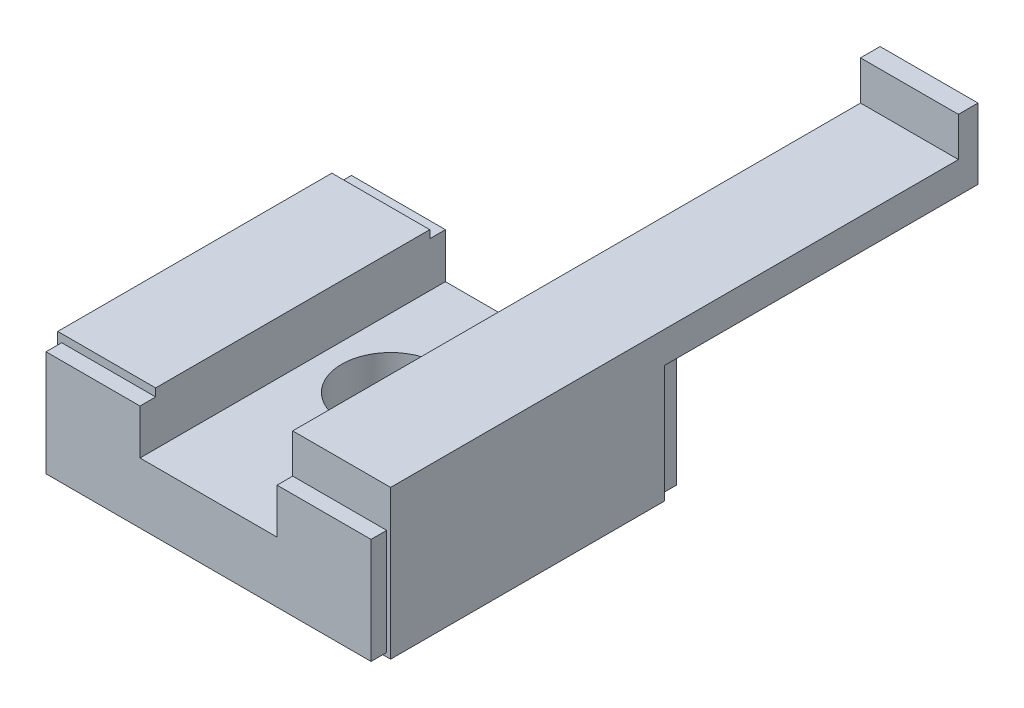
ISO-10303-21;
HEADER;
FILE_DESCRIPTION(('STEP AP214'),'2;1');
FILE_NAME('part.step','',(''),(''),'','','');
FILE_SCHEMA(('AUTOMOTIVE_DESIGN { 1 0 10303 214 1 1 1 1 }'));
ENDSEC;
DATA;
#1=APPLICATION_CONTEXT('core data for automotive mechanical design processes');
#2=APPLICATION_PROTOCOL_DEFINITION('international standard','automotive_design',2000,#1);
#3=PRODUCT_CONTEXT('',#1,'mechanical');
#4=PRODUCT('Part','Part','',(#3));
#5=PRODUCT_RELATED_PRODUCT_CATEGORY('part','',(#4));
#6=PRODUCT_DEFINITION_FORMATION('','',#4);
#7=PRODUCT_DEFINITION_CONTEXT('part definition',#1,'design');
#8=PRODUCT_DEFINITION('design','',#6,#7);
#9=PRODUCT_DEFINITION_SHAPE('','',#8);
#10=(LENGTH_UNIT() NAMED_UNIT(*) SI_UNIT(.MILLI.,.METRE.));
#11=(NAMED_UNIT(*) PLANE_ANGLE_UNIT() SI_UNIT($,.RADIAN.));
#12=(NAMED_UNIT(*) SI_UNIT($,.STERADIAN.) SOLID_ANGLE_UNIT());
#13=UNCERTAINTY_MEASURE_WITH_UNIT(LENGTH_MEASURE(1.E-05),#10,'distance_accuracy_value','');
#14=(GEOMETRIC_REPRESENTATION_CONTEXT(3) GLOBAL_UNCERTAINTY_ASSIGNED_CONTEXT((#13)) GLOBAL_UNIT_ASSIGNED_CONTEXT((#10,
#11,#12)) REPRESENTATION_CONTEXT('',''));
#15=CARTESIAN_POINT('',(0.,0.,0.));
#16=DIRECTION('',(0.,0.,1.));
#17=DIRECTION('',(1.,0.,0.));
#18=AXIS2_PLACEMENT_3D('',#15,#16,#17);
#19=CARTESIAN_POINT('',(3.5,7.6,14.8));
#20=DIRECTION('',(0.,1.,0.));
#21=DIRECTION('',(1.,0.,0.));
#22=AXIS2_PLACEMENT_3D('',#19,#20,#21);
#23=PLANE('',#22);
#24=DIRECTION('',(-1.,0.,0.));
#25=VECTOR('',#24,1.);
#26=CARTESIAN_POINT('',(8.5,7.6,-14.2));
#27=LINE('',#26,#25);
#28=CARTESIAN_POINT('',(3.5,7.6,-14.2));
#29=VERTEX_POINT('',#28);
#30=CARTESIAN_POINT('',(8.5,7.6,-14.2));
#31=VERTEX_POINT('',#30);
#32=EDGE_CURVE('E197',#29,#31,#27,.F.);
#33=ORIENTED_EDGE('',*,*,#32,.F.);
#34=DIRECTION('',(0.,0.,1.));
#35=VECTOR('',#34,1.);
#36=CARTESIAN_POINT('',(3.5,7.6,-14.2));
#37=LINE('',#36,#35);
#38=CARTESIAN_POINT('',(3.5,7.6,14.8));
#39=VERTEX_POINT('',#38);
#40=EDGE_CURVE('E212',#39,#29,#37,.F.);
#41=ORIENTED_EDGE('',*,*,#40,.F.);
#42=DIRECTION('',(1.,0.,0.));
#43=VECTOR('',#42,1.);
#44=CARTESIAN_POINT('',(3.5,7.6,14.8));
#45=LINE('',#44,#43);
#46=CARTESIAN_POINT('',(8.5,7.6,14.8));
#47=VERTEX_POINT('',#46);
#48=EDGE_CURVE('E221',#47,#39,#45,.F.);
#49=ORIENTED_EDGE('',*,*,#48,.F.);
#50=DIRECTION('',(0.,0.,-1.));
#51=VECTOR('',#50,1.);
#52=CARTESIAN_POINT('',(8.5,7.6,14.8));
#53=LINE('',#52,#51);
#54=EDGE_CURVE('E214',#47,#31,#53,.T.);
#55=ORIENTED_EDGE('',*,*,#54,.T.);
#56=EDGE_LOOP('',(#33,#41,#49,#55));
#57=FACE_BOUND('',#56,.T.);
#58=ADVANCED_FACE('F16',(#57),#23,.T.);
#59=CARTESIAN_POINT('',(-8.5,6.,14.8));
#60=DIRECTION('',(0.,1.,0.));
#61=DIRECTION('',(1.,0.,0.));
#62=AXIS2_PLACEMENT_3D('',#59,#60,#61);
#63=PLANE('',#62);
#64=DIRECTION('',(1.,0.,0.));
#65=VECTOR('',#64,1.);
#66=CARTESIAN_POINT('',(-8.5,6.,14.8));
#67=LINE('',#66,#65);
#68=CARTESIAN_POINT('',(-3.5,6.,14.8));
#69=VERTEX_POINT('',#68);
#70=CARTESIAN_POINT('',(-8.5,6.,14.8));
#71=VERTEX_POINT('',#70);
#72=EDGE_CURVE('E232',#69,#71,#67,.F.);
#73=ORIENTED_EDGE('',*,*,#72,.F.);
#74=DIRECTION('',(0.,0.,-1.));
#75=VECTOR('',#74,1.);
#76=CARTESIAN_POINT('',(-3.5,6.,14.8));
#77=LINE('',#76,#75);
#78=CARTESIAN_POINT('',(-3.5,6.,0.800000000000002));
#79=VERTEX_POINT('',#78);
#80=EDGE_CURVE('E236',#69,#79,#77,.T.);
#81=ORIENTED_EDGE('',*,*,#80,.T.);
#82=DIRECTION('',(-1.,0.,0.));
#83=VECTOR('',#82,1.);
#84=CARTESIAN_POINT('',(-3.5,6.,0.800000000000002));
#85=LINE('',#84,#83);
#86=CARTESIAN_POINT('',(-8.5,6.,0.800000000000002));
#87=VERTEX_POINT('',#86);
#88=EDGE_CURVE('E241',#79,#87,#85,.T.);
#89=ORIENTED_EDGE('',*,*,#88,.T.);
#90=DIRECTION('',(0.,0.,1.));
#91=VECTOR('',#90,1.);
#92=CARTESIAN_POINT('',(-8.5,6.,0.800000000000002));
#93=LINE('',#92,#91);
#94=EDGE_CURVE('E246',#71,#87,#93,.F.);
#95=ORIENTED_EDGE('',*,*,#94,.F.);
#96=EDGE_LOOP('',(#73,#81,#89,#95));
#97=FACE_BOUND('',#96,.T.);
#98=ADVANCED_FACE('F620',(#97),#63,.T.);
#99=CARTESIAN_POINT('',(-8.5,0.,14.8));
#100=DIRECTION('',(-1.,0.,0.));
#101=DIRECTION('',(0.,1.,0.));
#102=AXIS2_PLACEMENT_3D('',#99,#100,#101);
#103=PLANE('',#102);
#104=DIRECTION('',(0.,1.,0.));
#105=VECTOR('',#104,1.);
#106=CARTESIAN_POINT('',(-8.5,0.,14.8));
#107=LINE('',#106,#105);
#108=CARTESIAN_POINT('',(-8.5,0.,14.8));
#109=VERTEX_POINT('',#108);
#110=EDGE_CURVE('E251',#71,#109,#107,.F.);
#111=ORIENTED_EDGE('',*,*,#110,.F.);
#112=ORIENTED_EDGE('',*,*,#94,.T.);
#113=DIRECTION('',(0.,-1.,0.));
#114=VECTOR('',#113,1.);
#115=CARTESIAN_POINT('',(-8.5,6.,0.800000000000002));
#116=LINE('',#115,#114);
#117=CARTESIAN_POINT('',(-8.5,0.,0.800000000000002));
#118=VERTEX_POINT('',#117);
#119=EDGE_CURVE('E255',#87,#118,#116,.T.);
#120=ORIENTED_EDGE('',*,*,#119,.T.);
#121=DIRECTION('',(0.,0.,1.));
#122=VECTOR('',#121,1.);
#123=CARTESIAN_POINT('',(-8.5,0.,0.800000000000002));
#124=LINE('',#123,#122);
#125=EDGE_CURVE('E260',#109,#118,#124,.F.);
#126=ORIENTED_EDGE('',*,*,#125,.F.);
#127=EDGE_LOOP('',(#111,#112,#120,#126));
#128=FACE_BOUND('',#127,.T.);
#129=ADVANCED_FACE('F625',(#128),#103,.T.);
#130=CARTESIAN_POINT('',(-8.5,0.,0.800000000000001));
#131=DIRECTION('',(0.,-1.,0.));
#132=DIRECTION('',(1.,0.,0.));
#133=AXIS2_PLACEMENT_3D('',#130,#131,#132);
#134=PLANE('',#133);
#135=DIRECTION('',(-1.,0.,0.));
#136=VECTOR('',#135,1.);
#137=CARTESIAN_POINT('',(-3.5,0.,14.8));
#138=LINE('',#137,#136);
#139=CARTESIAN_POINT('',(-3.5,0.,14.8));
#140=VERTEX_POINT('',#139);
#141=EDGE_CURVE('E265',#109,#140,#138,.F.);
#142=ORIENTED_EDGE('',*,*,#141,.F.);
#143=ORIENTED_EDGE('',*,*,#125,.T.);
#144=DIRECTION('',(1.,0.,0.));
#145=VECTOR('',#144,1.);
#146=CARTESIAN_POINT('',(-8.5,0.,0.800000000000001));
#147=LINE('',#146,#145);
#148=CARTESIAN_POINT('',(-3.5,0.,0.800000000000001));
#149=VERTEX_POINT('',#148);
#150=EDGE_CURVE('E269',#118,#149,#147,.T.);
#151=ORIENTED_EDGE('',*,*,#150,.T.);
#152=DIRECTION('',(0.,0.,1.));
#153=VECTOR('',#152,1.);
#154=CARTESIAN_POINT('',(-3.5,0.,0.800000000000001));
#155=LINE('',#154,#153);
#156=EDGE_CURVE('E274',#140,#149,#155,.F.);
#157=ORIENTED_EDGE('',*,*,#156,.F.);
#158=EDGE_LOOP('',(#142,#143,#151,#157));
#159=FACE_BOUND('',#158,.T.);
#160=CARTESIAN_POINT('',(-6.,0.,7.8));
#161=DIRECTION('',(0.,1.,0.));
#162=DIRECTION('',(0.,0.,-1.));
#163=AXIS2_PLACEMENT_3D('',#160,#161,#162);
#164=CIRCLE('',#163,1.25);
#165=CARTESIAN_POINT('',(-6.,0.,6.55));
#166=VERTEX_POINT('',#165);
#167=EDGE_CURVE('E279',#166,#166,#164,.F.);
#168=ORIENTED_EDGE('',*,*,#167,.F.);
#169=EDGE_LOOP('',(#168));
#170=FACE_BOUND('',#169,.T.);
#171=ADVANCED_FACE('F631',(#159,#170),#134,.T.);
#172=CARTESIAN_POINT('',(-3.3,0.2,0.800000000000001));
#173=DIRECTION('',(0.707106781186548,-0.707106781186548,0.));
#174=DIRECTION('',(0.,0.,1.));
#175=AXIS2_PLACEMENT_3D('',#172,#173,#174);
#176=PLANE('',#175);
#177=DIRECTION('',(-0.707106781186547,-0.707106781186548,0.));
#178=VECTOR('',#177,1.);
#179=CARTESIAN_POINT('',(-3.3,0.2,14.8));
#180=LINE('',#179,#178);
#181=CARTESIAN_POINT('',(-3.3,0.2,14.8));
#182=VERTEX_POINT('',#181);
#183=EDGE_CURVE('E284',#140,#182,#180,.F.);
#184=ORIENTED_EDGE('',*,*,#183,.F.);
#185=ORIENTED_EDGE('',*,*,#156,.T.);
#186=DIRECTION('',(0.707106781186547,0.707106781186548,0.));
#187=VECTOR('',#186,1.);
#188=CARTESIAN_POINT('',(-3.5,0.,0.800000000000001));
#189=LINE('',#188,#187);
#190=CARTESIAN_POINT('',(-3.3,0.2,0.800000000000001));
#191=VERTEX_POINT('',#190);
#192=EDGE_CURVE('E286',#149,#191,#189,.T.);
#193=ORIENTED_EDGE('',*,*,#192,.T.);
#194=DIRECTION('',(0.,0.,1.));
#195=VECTOR('',#194,1.);
#196=CARTESIAN_POINT('',(-3.3,0.2,0.800000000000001));
#197=LINE('',#196,#195);
#198=EDGE_CURVE('E291',#182,#191,#197,.F.);
#199=ORIENTED_EDGE('',*,*,#198,.F.);
#200=EDGE_LOOP('',(#184,#185,#193,#199));
#201=FACE_BOUND('',#200,.T.);
#202=ADVANCED_FACE('F635',(#201),#176,.T.);
#203=CARTESIAN_POINT('',(3.5,0.,0.800000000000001));
#204=DIRECTION('',(-0.707106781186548,-0.707106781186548,0.));
#205=DIRECTION('',(0.,0.,1.));
#206=AXIS2_PLACEMENT_3D('',#203,#204,#205);
#207=PLANE('',#206);
#208=DIRECTION('',(-0.707106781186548,0.707106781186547,0.));
#209=VECTOR('',#208,1.);
#210=CARTESIAN_POINT('',(3.5,0.,14.8));
#211=LINE('',#210,#209);
#212=CARTESIAN_POINT('',(3.3,0.2,14.8));
#213=VERTEX_POINT('',#212);
#214=CARTESIAN_POINT('',(3.5,0.,14.8));
#215=VERTEX_POINT('',#214);
#216=EDGE_CURVE('E296',#213,#215,#211,.F.);
#217=ORIENTED_EDGE('',*,*,#216,.F.);
#218=DIRECTION('',(0.,0.,-1.));
#219=VECTOR('',#218,1.);
#220=CARTESIAN_POINT('',(3.3,0.2,14.8));
#221=LINE('',#220,#219);
#222=CARTESIAN_POINT('',(3.3,0.2,0.800000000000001));
#223=VERTEX_POINT('',#222);
#224=EDGE_CURVE('E300',#213,#223,#221,.T.);
#225=ORIENTED_EDGE('',*,*,#224,.T.);
#226=DIRECTION('',(0.707106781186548,-0.707106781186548,0.));
#227=VECTOR('',#226,1.);
#228=CARTESIAN_POINT('',(3.3,0.2,0.800000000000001));
#229=LINE('',#228,#227);
#230=CARTESIAN_POINT('',(3.5,0.,0.800000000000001));
#231=VERTEX_POINT('',#230);
#232=EDGE_CURVE('E305',#223,#231,#229,.T.);
#233=ORIENTED_EDGE('',*,*,#232,.T.);
#234=DIRECTION('',(0.,0.,1.));
#235=VECTOR('',#234,1.);
#236=CARTESIAN_POINT('',(3.5,0.,0.800000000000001));
#237=LINE('',#236,#235);
#238=EDGE_CURVE('E310',#215,#231,#237,.F.);
#239=ORIENTED_EDGE('',*,*,#238,.F.);
#240=EDGE_LOOP('',(#217,#225,#233,#239));
#241=FACE_BOUND('',#240,.T.);
#242=ADVANCED_FACE('F639',(#241),#207,.T.);
#243=CARTESIAN_POINT('',(3.5,0.,0.800000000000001));
#244=DIRECTION('',(0.,-1.,0.));
#245=DIRECTION('',(1.,0.,0.));
#246=AXIS2_PLACEMENT_3D('',#243,#244,#245);
#247=PLANE('',#246);
#248=DIRECTION('',(-1.,0.,0.));
#249=VECTOR('',#248,1.);
#250=CARTESIAN_POINT('',(8.5,0.,14.8));
#251=LINE('',#250,#249);
#252=CARTESIAN_POINT('',(8.5,0.,14.8));
#253=VERTEX_POINT('',#252);
#254=EDGE_CURVE('E315',#215,#253,#251,.F.);
#255=ORIENTED_EDGE('',*,*,#254,.F.);
#256=ORIENTED_EDGE('',*,*,#238,.T.);
#257=DIRECTION('',(1.,0.,0.));
#258=VECTOR('',#257,1.);
#259=CARTESIAN_POINT('',(3.5,0.,0.800000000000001));
#260=LINE('',#259,#258);
#261=CARTESIAN_POINT('',(8.5,0.,0.800000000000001));
#262=VERTEX_POINT('',#261);
#263=EDGE_CURVE('E319',#231,#262,#260,.T.);
#264=ORIENTED_EDGE('',*,*,#263,.T.);
#265=DIRECTION('',(0.,0.,1.));
#266=VECTOR('',#265,1.);
#267=CARTESIAN_POINT('',(8.5,0.,0.800000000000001));
#268=LINE('',#267,#266);
#269=EDGE_CURVE('E324',#253,#262,#268,.F.);
#270=ORIENTED_EDGE('',*,*,#269,.F.);
#271=EDGE_LOOP('',(#255,#256,#264,#270));
#272=FACE_BOUND('',#271,.T.);
#273=CARTESIAN_POINT('',(6.,0.,7.8));
#274=DIRECTION('',(0.,1.,0.));
#275=DIRECTION('',(0.,0.,-1.));
#276=AXIS2_PLACEMENT_3D('',#273,#274,#275);
#277=CIRCLE('',#276,1.25);
#278=CARTESIAN_POINT('',(6.,0.,6.55));
#279=VERTEX_POINT('',#278);
#280=EDGE_CURVE('E329',#279,#279,#277,.F.);
#281=ORIENTED_EDGE('',*,*,#280,.F.);
#282=EDGE_LOOP('',(#281));
#283=FACE_BOUND('',#282,.T.);
#284=ADVANCED_FACE('F643',(#272,#283),#247,.T.);
#285=CARTESIAN_POINT('',(8.5,0.,-15.2));
#286=DIRECTION('',(1.,0.,0.));
#287=DIRECTION('',(0.,1.,0.));
#288=AXIS2_PLACEMENT_3D('',#285,#286,#287);
#289=PLANE('',#288);
#290=DIRECTION('',(0.,-1.,0.));
#291=VECTOR('',#290,1.);
#292=CARTESIAN_POINT('',(8.5,7.6,14.8));
#293=LINE('',#292,#291);
#294=EDGE_CURVE('E334',#253,#47,#293,.F.);
#295=ORIENTED_EDGE('',*,*,#294,.F.);
#296=ORIENTED_EDGE('',*,*,#269,.T.);
#297=DIRECTION('',(0.,1.,0.));
#298=VECTOR('',#297,1.);
#299=CARTESIAN_POINT('',(8.5,0.,0.800000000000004));
#300=LINE('',#299,#298);
#301=CARTESIAN_POINT('',(8.5,6.,0.800000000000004));
#302=VERTEX_POINT('',#301);
#303=EDGE_CURVE('E336',#262,#302,#300,.T.);
#304=ORIENTED_EDGE('',*,*,#303,.T.);
#305=DIRECTION('',(0.,0.,-1.));
#306=VECTOR('',#305,1.);
#307=CARTESIAN_POINT('',(8.5,6.,0.800000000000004));
#308=LINE('',#307,#306);
#309=CARTESIAN_POINT('',(8.5,6.,-15.2));
#310=VERTEX_POINT('',#309);
#311=EDGE_CURVE('E341',#310,#302,#308,.F.);
#312=ORIENTED_EDGE('',*,*,#311,.F.);
#313=DIRECTION('',(0.,1.,0.));
#314=VECTOR('',#313,1.);
#315=CARTESIAN_POINT('',(8.5,6.,-15.2));
#316=LINE('',#315,#314);
#317=CARTESIAN_POINT('',(8.5,9.6,-15.2));
#318=VERTEX_POINT('',#317);
#319=EDGE_CURVE('E345',#310,#318,#316,.T.);
#320=ORIENTED_EDGE('',*,*,#319,.T.);
#321=DIRECTION('',(0.,0.,1.));
#322=VECTOR('',#321,1.);
#323=CARTESIAN_POINT('',(8.5,9.6,-15.2));
#324=LINE('',#323,#322);
#325=CARTESIAN_POINT('',(8.5,9.6,-14.2));
#326=VERTEX_POINT('',#325);
#327=EDGE_CURVE('E350',#326,#318,#324,.F.);
#328=ORIENTED_EDGE('',*,*,#327,.F.);
#329=DIRECTION('',(0.,-1.,0.));
#330=VECTOR('',#329,1.);
#331=CARTESIAN_POINT('',(8.5,9.6,-14.2));
#332=LINE('',#331,#330);
#333=EDGE_CURVE('E354',#31,#326,#332,.F.);
#334=ORIENTED_EDGE('',*,*,#333,.F.);
#335=ORIENTED_EDGE('',*,*,#54,.F.);
#336=EDGE_LOOP('',(#295,#296,#304,#312,#320,#328,#334,#335));
#337=FACE_BOUND('',#336,.T.);
#338=ADVANCED_FACE('F647',(#337),#289,.T.);
#339=CARTESIAN_POINT('',(3.5,3.3,15.6));
#340=DIRECTION('',(-1.,0.,0.));
#341=DIRECTION('',(0.,1.,0.));
#342=AXIS2_PLACEMENT_3D('',#339,#340,#341);
#343=PLANE('',#342);
#344=DIRECTION('',(0.,1.,0.));
#345=VECTOR('',#344,1.);
#346=CARTESIAN_POINT('',(3.5,3.3,15.6));
#347=LINE('',#346,#345);
#348=CARTESIAN_POINT('',(3.5,5.6,15.6));
#349=VERTEX_POINT('',#348);
#350=CARTESIAN_POINT('',(3.5,3.3,15.6));
#351=VERTEX_POINT('',#350);
#352=EDGE_CURVE('E358',#349,#351,#347,.F.);
#353=ORIENTED_EDGE('',*,*,#352,.F.);
#354=DIRECTION('',(0.,0.,-1.));
#355=VECTOR('',#354,1.);
#356=CARTESIAN_POINT('',(3.5,5.6,15.6));
#357=LINE('',#356,#355);
#358=CARTESIAN_POINT('',(3.5,5.6,14.8));
#359=VERTEX_POINT('',#358);
#360=EDGE_CURVE('E362',#359,#349,#357,.F.);
#361=ORIENTED_EDGE('',*,*,#360,.F.);
#362=DIRECTION('',(0.,1.,0.));
#363=VECTOR('',#362,1.);
#364=CARTESIAN_POINT('',(3.5,5.6,14.8));
#365=LINE('',#364,#363);
#366=EDGE_CURVE('E206',#39,#359,#365,.F.);
#367=ORIENTED_EDGE('',*,*,#366,.F.);
#368=ORIENTED_EDGE('',*,*,#40,.T.);
#369=DIRECTION('',(0.,1.,0.));
#370=VECTOR('',#369,1.);
#371=CARTESIAN_POINT('',(3.5,7.6,-14.2));
#372=LINE('',#371,#370);
#373=CARTESIAN_POINT('',(3.5,9.6,-14.2));
#374=VERTEX_POINT('',#373);
#375=EDGE_CURVE('E194',#374,#29,#372,.F.);
#376=ORIENTED_EDGE('',*,*,#375,.F.);
#377=DIRECTION('',(0.,0.,-1.));
#378=VECTOR('',#377,1.);
#379=CARTESIAN_POINT('',(3.5,9.6,-14.2));
#380=LINE('',#379,#378);
#381=CARTESIAN_POINT('',(3.5,9.6,-15.2));
#382=VERTEX_POINT('',#381);
#383=EDGE_CURVE('E205',#374,#382,#380,.T.);
#384=ORIENTED_EDGE('',*,*,#383,.T.);
#385=DIRECTION('',(0.,-1.,0.));
#386=VECTOR('',#385,1.);
#387=CARTESIAN_POINT('',(3.5,9.6,-15.2));
#388=LINE('',#387,#386);
#389=CARTESIAN_POINT('',(3.5,6.,-15.2));
#390=VERTEX_POINT('',#389);
#391=EDGE_CURVE('E374',#382,#390,#388,.T.);
#392=ORIENTED_EDGE('',*,*,#391,.T.);
#393=DIRECTION('',(0.,0.,1.));
#394=VECTOR('',#393,1.);
#395=CARTESIAN_POINT('',(3.5,6.,-15.2));
#396=LINE('',#395,#394);
#397=CARTESIAN_POINT('',(3.5,6.,0.));
#398=VERTEX_POINT('',#397);
#399=EDGE_CURVE('E379',#390,#398,#396,.T.);
#400=ORIENTED_EDGE('',*,*,#399,.T.);
#401=DIRECTION('',(0.,-1.,0.));
#402=VECTOR('',#401,1.);
#403=CARTESIAN_POINT('',(3.5,6.,0.));
#404=LINE('',#403,#402);
#405=CARTESIAN_POINT('',(3.5,3.3,0.));
#406=VERTEX_POINT('',#405);
#407=EDGE_CURVE('E384',#398,#406,#404,.T.);
#408=ORIENTED_EDGE('',*,*,#407,.T.);
#409=DIRECTION('',(0.,0.,1.));
#410=VECTOR('',#409,1.);
#411=CARTESIAN_POINT('',(3.5,3.3,0.));
#412=LINE('',#411,#410);
#413=EDGE_CURVE('E389',#351,#406,#412,.F.);
#414=ORIENTED_EDGE('',*,*,#413,.F.);
#415=EDGE_LOOP('',(#353,#361,#367,#368,#376,#384,#392,#400,#408,#414));
#416=FACE_BOUND('',#415,.T.);
#417=ADVANCED_FACE('F218',(#416),#343,.T.);
#418=CARTESIAN_POINT('',(-3.5,3.3,0.));
#419=DIRECTION('',(1.,0.,0.));
#420=DIRECTION('',(0.,1.,0.));
#421=AXIS2_PLACEMENT_3D('',#418,#419,#420);
#422=PLANE('',#421);
#423=DIRECTION('',(0.,-1.,0.));
#424=VECTOR('',#423,1.);
#425=CARTESIAN_POINT('',(-3.5,6.,14.8));
#426=LINE('',#425,#424);
#427=CARTESIAN_POINT('',(-3.5,5.6,14.8));
#428=VERTEX_POINT('',#427);
#429=EDGE_CURVE('E393',#428,#69,#426,.F.);
#430=ORIENTED_EDGE('',*,*,#429,.F.);
#431=DIRECTION('',(0.,0.,1.));
#432=VECTOR('',#431,1.);
#433=CARTESIAN_POINT('',(-3.5,5.6,14.8));
#434=LINE('',#433,#432);
#435=CARTESIAN_POINT('',(-3.5,5.6,15.6));
#436=VERTEX_POINT('',#435);
#437=EDGE_CURVE('E397',#428,#436,#434,.T.);
#438=ORIENTED_EDGE('',*,*,#437,.T.);
#439=DIRECTION('',(0.,-1.,0.));
#440=VECTOR('',#439,1.);
#441=CARTESIAN_POINT('',(-3.5,5.6,15.6));
#442=LINE('',#441,#440);
#443=CARTESIAN_POINT('',(-3.5,3.3,15.6));
#444=VERTEX_POINT('',#443);
#445=EDGE_CURVE('E402',#444,#436,#442,.F.);
#446=ORIENTED_EDGE('',*,*,#445,.F.);
#447=DIRECTION('',(0.,0.,-1.));
#448=VECTOR('',#447,1.);
#449=CARTESIAN_POINT('',(-3.5,3.3,15.6));
#450=LINE('',#449,#448);
#451=CARTESIAN_POINT('',(-3.5,3.3,0.));
#452=VERTEX_POINT('',#451);
#453=EDGE_CURVE('E407',#444,#452,#450,.T.);
#454=ORIENTED_EDGE('',*,*,#453,.T.);
#455=DIRECTION('',(0.,1.,0.));
#456=VECTOR('',#455,1.);
#457=CARTESIAN_POINT('',(-3.5,3.3,0.));
#458=LINE('',#457,#456);
#459=CARTESIAN_POINT('',(-3.5,5.6,0.));
#460=VERTEX_POINT('',#459);
#461=EDGE_CURVE('E412',#452,#460,#458,.T.);
#462=ORIENTED_EDGE('',*,*,#461,.T.);
#463=DIRECTION('',(0.,0.,1.));
#464=VECTOR('',#463,1.);
#465=CARTESIAN_POINT('',(-3.5,5.6,0.));
#466=LINE('',#465,#464);
#467=CARTESIAN_POINT('',(-3.5,5.6,0.800000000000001));
#468=VERTEX_POINT('',#467);
#469=EDGE_CURVE('E417',#468,#460,#466,.F.);
#470=ORIENTED_EDGE('',*,*,#469,.F.);
#471=DIRECTION('',(0.,1.,0.));
#472=VECTOR('',#471,1.);
#473=CARTESIAN_POINT('',(-3.5,5.6,0.800000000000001));
#474=LINE('',#473,#472);
#475=EDGE_CURVE('E421',#468,#79,#474,.T.);
#476=ORIENTED_EDGE('',*,*,#475,.T.);
#477=ORIENTED_EDGE('',*,*,#80,.F.);
#478=EDGE_LOOP('',(#430,#438,#446,#454,#462,#470,#476,#477));
#479=FACE_BOUND('',#478,.T.);
#480=ADVANCED_FACE('F654',(#479),#422,.T.);
#481=CARTESIAN_POINT('',(-8.3,0.2,0.));
#482=DIRECTION('',(0.,0.,-1.));
#483=DIRECTION('',(0.,1.,0.));
#484=AXIS2_PLACEMENT_3D('',#481,#482,#483);
#485=PLANE('',#484);
#486=DIRECTION('',(1.,0.,0.));
#487=VECTOR('',#486,1.);
#488=CARTESIAN_POINT('',(3.5,6.,0.));
#489=LINE('',#488,#487);
#490=CARTESIAN_POINT('',(8.3,6.,0.));
#491=VERTEX_POINT('',#490);
#492=EDGE_CURVE('E426',#398,#491,#489,.T.);
#493=ORIENTED_EDGE('',*,*,#492,.T.);
#494=DIRECTION('',(0.,-1.,0.));
#495=VECTOR('',#494,1.);
#496=CARTESIAN_POINT('',(8.3,6.,0.));
#497=LINE('',#496,#495);
#498=CARTESIAN_POINT('',(8.3,0.200000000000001,0.));
#499=VERTEX_POINT('',#498);
#500=EDGE_CURVE('E431',#491,#499,#497,.T.);
#501=ORIENTED_EDGE('',*,*,#500,.T.);
#502=DIRECTION('',(-1.,0.,0.));
#503=VECTOR('',#502,1.);
#504=CARTESIAN_POINT('',(8.3,0.2,0.));
#505=LINE('',#504,#503);
#506=CARTESIAN_POINT('',(-8.3,0.2,0.));
#507=VERTEX_POINT('',#506);
#508=EDGE_CURVE('E436',#507,#499,#505,.F.);
#509=ORIENTED_EDGE('',*,*,#508,.F.);
#510=DIRECTION('',(0.,1.,0.));
#511=VECTOR('',#510,1.);
#512=CARTESIAN_POINT('',(-8.3,0.2,0.));
#513=LINE('',#512,#511);
#514=CARTESIAN_POINT('',(-8.3,5.6,0.));
#515=VERTEX_POINT('',#514);
#516=EDGE_CURVE('E441',#507,#515,#513,.T.);
#517=ORIENTED_EDGE('',*,*,#516,.T.);
#518=DIRECTION('',(1.,0.,0.));
#519=VECTOR('',#518,1.);
#520=CARTESIAN_POINT('',(-8.3,5.6,0.));
#521=LINE('',#520,#519);
#522=EDGE_CURVE('E446',#515,#460,#521,.T.);
#523=ORIENTED_EDGE('',*,*,#522,.T.);
#524=ORIENTED_EDGE('',*,*,#461,.F.);
#525=DIRECTION('',(1.,0.,0.));
#526=VECTOR('',#525,1.);
#527=CARTESIAN_POINT('',(-3.5,3.3,0.));
#528=LINE('',#527,#526);
#529=EDGE_CURVE('E451',#406,#452,#528,.F.);
#530=ORIENTED_EDGE('',*,*,#529,.F.);
#531=ORIENTED_EDGE('',*,*,#407,.F.);
#532=EDGE_LOOP('',(#493,#501,#509,#517,#523,#524,#530,#531));
#533=FACE_BOUND('',#532,.T.);
#534=ADVANCED_FACE('F657',(#533),#485,.T.);
#535=CARTESIAN_POINT('',(-8.3,0.2,0.));
#536=DIRECTION('',(0.,-1.,0.));
#537=DIRECTION('',(1.,0.,0.));
#538=AXIS2_PLACEMENT_3D('',#535,#536,#537);
#539=PLANE('',#538);
#540=DIRECTION('',(-1.,0.,0.));
#541=VECTOR('',#540,1.);
#542=CARTESIAN_POINT('',(8.3,0.2,15.6));
#543=LINE('',#542,#541);
#544=CARTESIAN_POINT('',(-8.3,0.2,15.6));
#545=VERTEX_POINT('',#544);
#546=CARTESIAN_POINT('',(8.3,0.2,15.6));
#547=VERTEX_POINT('',#546);
#548=EDGE_CURVE('E455',#545,#547,#543,.F.);
#549=ORIENTED_EDGE('',*,*,#548,.F.);
#550=DIRECTION('',(0.,0.,-1.));
#551=VECTOR('',#550,1.);
#552=CARTESIAN_POINT('',(-8.3,0.2,15.6));
#553=LINE('',#552,#551);
#554=CARTESIAN_POINT('',(-8.3,0.2,14.8));
#555=VERTEX_POINT('',#554);
#556=EDGE_CURVE('E460',#555,#545,#553,.F.);
#557=ORIENTED_EDGE('',*,*,#556,.F.);
#558=DIRECTION('',(1.,0.,0.));
#559=VECTOR('',#558,1.);
#560=CARTESIAN_POINT('',(-8.3,0.2,14.8));
#561=LINE('',#560,#559);
#562=EDGE_CURVE('E464',#182,#555,#561,.F.);
#563=ORIENTED_EDGE('',*,*,#562,.F.);
#564=ORIENTED_EDGE('',*,*,#198,.T.);
#565=DIRECTION('',(-1.,0.,0.));
#566=VECTOR('',#565,1.);
#567=CARTESIAN_POINT('',(-3.3,0.2,0.800000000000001));
#568=LINE('',#567,#566);
#569=CARTESIAN_POINT('',(-8.3,0.2,0.800000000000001));
#570=VERTEX_POINT('',#569);
#571=EDGE_CURVE('E468',#191,#570,#568,.T.);
#572=ORIENTED_EDGE('',*,*,#571,.T.);
#573=DIRECTION('',(0.,0.,-1.));
#574=VECTOR('',#573,1.);
#575=CARTESIAN_POINT('',(-8.3,0.2,0.800000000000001));
#576=LINE('',#575,#574);
#577=EDGE_CURVE('E473',#570,#507,#576,.T.);
#578=ORIENTED_EDGE('',*,*,#577,.T.);
#579=ORIENTED_EDGE('',*,*,#508,.T.);
#580=DIRECTION('',(0.,0.,1.));
#581=VECTOR('',#580,1.);
#582=CARTESIAN_POINT('',(8.3,0.2,0.));
#583=LINE('',#582,#581);
#584=CARTESIAN_POINT('',(8.3,0.2,0.800000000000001));
#585=VERTEX_POINT('',#584);
#586=EDGE_CURVE('E478',#585,#499,#583,.F.);
#587=ORIENTED_EDGE('',*,*,#586,.F.);
#588=DIRECTION('',(-1.,0.,0.));
#589=VECTOR('',#588,1.);
#590=CARTESIAN_POINT('',(8.3,0.2,0.800000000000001));
#591=LINE('',#590,#589);
#592=EDGE_CURVE('E482',#585,#223,#591,.T.);
#593=ORIENTED_EDGE('',*,*,#592,.T.);
#594=ORIENTED_EDGE('',*,*,#224,.F.);
#595=DIRECTION('',(1.,0.,0.));
#596=VECTOR('',#595,1.);
#597=CARTESIAN_POINT('',(3.3,0.2,14.8));
#598=LINE('',#597,#596);
#599=CARTESIAN_POINT('',(8.3,0.2,14.8));
#600=VERTEX_POINT('',#599);
#601=EDGE_CURVE('E487',#600,#213,#598,.F.);
#602=ORIENTED_EDGE('',*,*,#601,.F.);
#603=DIRECTION('',(0.,0.,1.));
#604=VECTOR('',#603,1.);
#605=CARTESIAN_POINT('',(8.3,0.2,14.8));
#606=LINE('',#605,#604);
#607=EDGE_CURVE('E491',#600,#547,#606,.T.);
#608=ORIENTED_EDGE('',*,*,#607,.T.);
#609=EDGE_LOOP('',(#549,#557,#563,#564,#572,#578,#579,#587,#593,#594,#602,#608));
#610=FACE_BOUND('',#609,.T.);
#611=CARTESIAN_POINT('',(0.,0.2,6.3));
#612=DIRECTION('',(0.,1.,0.));
#613=DIRECTION('',(0.,0.,-1.));
#614=AXIS2_PLACEMENT_3D('',#611,#612,#613);
#615=CIRCLE('',#614,2.5);
#616=CARTESIAN_POINT('',(0.,0.2,3.8));
#617=VERTEX_POINT('',#616);
#618=EDGE_CURVE('E496',#617,#617,#615,.F.);
#619=ORIENTED_EDGE('',*,*,#618,.F.);
#620=EDGE_LOOP('',(#619));
#621=FACE_BOUND('',#620,.T.);
#622=CARTESIAN_POINT('',(0.,0.2,11.8));
#623=DIRECTION('',(0.,1.,0.));
#624=DIRECTION('',(0.,0.,-1.));
#625=AXIS2_PLACEMENT_3D('',#622,#623,#624);
#626=CIRCLE('',#625,1.);
#627=CARTESIAN_POINT('',(0.,0.2,10.8));
#628=VERTEX_POINT('',#627);
#629=EDGE_CURVE('E501',#628,#628,#626,.F.);
#630=ORIENTED_EDGE('',*,*,#629,.F.);
#631=EDGE_LOOP('',(#630));
#632=FACE_BOUND('',#631,.T.);
#633=ADVANCED_FACE('F661',(#610,#621,#632),#539,.T.);
#634=CARTESIAN_POINT('',(-3.5,3.3,15.6));
#635=DIRECTION('',(0.,1.,0.));
#636=DIRECTION('',(1.,0.,0.));
#637=AXIS2_PLACEMENT_3D('',#634,#635,#636);
#638=PLANE('',#637);
#639=ORIENTED_EDGE('',*,*,#529,.T.);
#640=ORIENTED_EDGE('',*,*,#453,.F.);
#641=DIRECTION('',(1.,0.,0.));
#642=VECTOR('',#641,1.);
#643=CARTESIAN_POINT('',(-3.5,3.3,15.6));
#644=LINE('',#643,#642);
#645=EDGE_CURVE('E504',#351,#444,#644,.F.);
#646=ORIENTED_EDGE('',*,*,#645,.F.);
#647=ORIENTED_EDGE('',*,*,#413,.T.);
#648=EDGE_LOOP('',(#639,#640,#646,#647));
#649=FACE_BOUND('',#648,.T.);
#650=CARTESIAN_POINT('',(0.,3.3,6.3));
#651=DIRECTION('',(0.,-1.,0.));
#652=DIRECTION('',(0.,0.,1.));
#653=AXIS2_PLACEMENT_3D('',#650,#651,#652);
#654=CIRCLE('',#653,2.5);
#655=CARTESIAN_POINT('',(0.,3.3,8.8));
#656=VERTEX_POINT('',#655);
#657=EDGE_CURVE('E506',#656,#656,#654,.F.);
#658=ORIENTED_EDGE('',*,*,#657,.F.);
#659=EDGE_LOOP('',(#658));
#660=FACE_BOUND('',#659,.T.);
#661=ADVANCED_FACE('F665',(#649,#660),#638,.T.);
#662=CARTESIAN_POINT('',(-8.3,0.2,15.6));
#663=DIRECTION('',(0.,0.,1.));
#664=DIRECTION('',(1.,0.,0.));
#665=AXIS2_PLACEMENT_3D('',#662,#663,#664);
#666=PLANE('',#665);
#667=DIRECTION('',(-1.,0.,0.));
#668=VECTOR('',#667,1.);
#669=CARTESIAN_POINT('',(8.3,5.6,15.6));
#670=LINE('',#669,#668);
#671=CARTESIAN_POINT('',(8.3,5.6,15.6));
#672=VERTEX_POINT('',#671);
#673=EDGE_CURVE('E511',#349,#672,#670,.F.);
#674=ORIENTED_EDGE('',*,*,#673,.F.);
#675=ORIENTED_EDGE('',*,*,#352,.T.);
#676=ORIENTED_EDGE('',*,*,#645,.T.);
#677=ORIENTED_EDGE('',*,*,#445,.T.);
#678=DIRECTION('',(-1.,0.,0.));
#679=VECTOR('',#678,1.);
#680=CARTESIAN_POINT('',(-3.5,5.6,15.6));
#681=LINE('',#680,#679);
#682=CARTESIAN_POINT('',(-8.3,5.6,15.6));
#683=VERTEX_POINT('',#682);
#684=EDGE_CURVE('E514',#683,#436,#681,.F.);
#685=ORIENTED_EDGE('',*,*,#684,.F.);
#686=DIRECTION('',(0.,-1.,0.));
#687=VECTOR('',#686,1.);
#688=CARTESIAN_POINT('',(-8.3,5.6,15.6));
#689=LINE('',#688,#687);
#690=EDGE_CURVE('E518',#545,#683,#689,.F.);
#691=ORIENTED_EDGE('',*,*,#690,.F.);
#692=ORIENTED_EDGE('',*,*,#548,.T.);
#693=DIRECTION('',(0.,1.,0.));
#694=VECTOR('',#693,1.);
#695=CARTESIAN_POINT('',(8.3,0.2,15.6));
#696=LINE('',#695,#694);
#697=EDGE_CURVE('E522',#672,#547,#696,.F.);
#698=ORIENTED_EDGE('',*,*,#697,.F.);
#699=EDGE_LOOP('',(#674,#675,#676,#677,#685,#691,#692,#698));
#700=FACE_BOUND('',#699,.T.);
#701=ADVANCED_FACE('F669',(#700),#666,.T.);
#702=CARTESIAN_POINT('',(-8.3,5.6,0.));
#703=DIRECTION('',(0.,1.,0.));
#704=DIRECTION('',(0.,0.,1.));
#705=AXIS2_PLACEMENT_3D('',#702,#703,#704);
#706=PLANE('',#705);
#707=ORIENTED_EDGE('',*,*,#522,.F.);
#708=DIRECTION('',(0.,0.,1.));
#709=VECTOR('',#708,1.);
#710=CARTESIAN_POINT('',(-8.3,5.6,0.));
#711=LINE('',#710,#709);
#712=CARTESIAN_POINT('',(-8.3,5.6,0.8));
#713=VERTEX_POINT('',#712);
#714=EDGE_CURVE('E526',#713,#515,#711,.F.);
#715=ORIENTED_EDGE('',*,*,#714,.F.);
#716=DIRECTION('',(1.,0.,0.));
#717=VECTOR('',#716,1.);
#718=CARTESIAN_POINT('',(-8.3,5.6,0.8));
#719=LINE('',#718,#717);
#720=EDGE_CURVE('E530',#713,#468,#719,.T.);
#721=ORIENTED_EDGE('',*,*,#720,.T.);
#722=ORIENTED_EDGE('',*,*,#469,.T.);
#723=EDGE_LOOP('',(#707,#715,#721,#722));
#724=FACE_BOUND('',#723,.T.);
#725=ADVANCED_FACE('F673',(#724),#706,.T.);
#726=CARTESIAN_POINT('',(-8.3,0.2,0.));
#727=DIRECTION('',(-1.,0.,0.));
#728=DIRECTION('',(0.,0.,1.));
#729=AXIS2_PLACEMENT_3D('',#726,#727,#728);
#730=PLANE('',#729);
#731=ORIENTED_EDGE('',*,*,#516,.F.);
#732=ORIENTED_EDGE('',*,*,#577,.F.);
#733=DIRECTION('',(0.,1.,0.));
#734=VECTOR('',#733,1.);
#735=CARTESIAN_POINT('',(-8.3,0.2,0.8));
#736=LINE('',#735,#734);
#737=EDGE_CURVE('E535',#570,#713,#736,.T.);
#738=ORIENTED_EDGE('',*,*,#737,.T.);
#739=ORIENTED_EDGE('',*,*,#714,.T.);
#740=EDGE_LOOP('',(#731,#732,#738,#739));
#741=FACE_BOUND('',#740,.T.);
#742=ADVANCED_FACE('F677',(#741),#730,.T.);
#743=CARTESIAN_POINT('',(-8.5,0.,0.8));
#744=DIRECTION('',(0.,0.,-1.));
#745=DIRECTION('',(0.,1.,0.));
#746=AXIS2_PLACEMENT_3D('',#743,#744,#745);
#747=PLANE('',#746);
#748=ORIENTED_EDGE('',*,*,#150,.F.);
#749=ORIENTED_EDGE('',*,*,#119,.F.);
#750=ORIENTED_EDGE('',*,*,#88,.F.);
#751=ORIENTED_EDGE('',*,*,#475,.F.);
#752=ORIENTED_EDGE('',*,*,#720,.F.);
#753=ORIENTED_EDGE('',*,*,#737,.F.);
#754=ORIENTED_EDGE('',*,*,#571,.F.);
#755=ORIENTED_EDGE('',*,*,#192,.F.);
#756=EDGE_LOOP('',(#748,#749,#750,#751,#752,#753,#754,#755));
#757=FACE_BOUND('',#756,.T.);
#758=ADVANCED_FACE('F681',(#757),#747,.T.);
#759=CARTESIAN_POINT('',(3.3,0.,0.8));
#760=DIRECTION('',(0.,0.,-1.));
#761=DIRECTION('',(0.,1.,0.));
#762=AXIS2_PLACEMENT_3D('',#759,#760,#761);
#763=PLANE('',#762);
#764=DIRECTION('',(0.,1.,0.));
#765=VECTOR('',#764,1.);
#766=CARTESIAN_POINT('',(8.3,0.2,0.8));
#767=LINE('',#766,#765);
#768=CARTESIAN_POINT('',(8.3,6.,0.8));
#769=VERTEX_POINT('',#768);
#770=EDGE_CURVE('E540',#769,#585,#767,.F.);
#771=ORIENTED_EDGE('',*,*,#770,.F.);
#772=DIRECTION('',(1.,0.,0.));
#773=VECTOR('',#772,1.);
#774=CARTESIAN_POINT('',(8.3,6.,0.8));
#775=LINE('',#774,#773);
#776=EDGE_CURVE('E544',#769,#302,#775,.T.);
#777=ORIENTED_EDGE('',*,*,#776,.T.);
#778=ORIENTED_EDGE('',*,*,#303,.F.);
#779=ORIENTED_EDGE('',*,*,#263,.F.);
#780=ORIENTED_EDGE('',*,*,#232,.F.);
#781=ORIENTED_EDGE('',*,*,#592,.F.);
#782=EDGE_LOOP('',(#771,#777,#778,#779,#780,#781));
#783=FACE_BOUND('',#782,.T.);
#784=ADVANCED_FACE('F685',(#783),#763,.T.);
#785=CARTESIAN_POINT('',(8.3,0.2,0.8));
#786=DIRECTION('',(1.,0.,0.));
#787=DIRECTION('',(0.,0.,-1.));
#788=AXIS2_PLACEMENT_3D('',#785,#786,#787);
#789=PLANE('',#788);
#790=ORIENTED_EDGE('',*,*,#500,.F.);
#791=DIRECTION('',(0.,0.,1.));
#792=VECTOR('',#791,1.);
#793=CARTESIAN_POINT('',(8.3,6.,0.));
#794=LINE('',#793,#792);
#795=EDGE_CURVE('E549',#769,#491,#794,.F.);
#796=ORIENTED_EDGE('',*,*,#795,.F.);
#797=ORIENTED_EDGE('',*,*,#770,.T.);
#798=ORIENTED_EDGE('',*,*,#586,.T.);
#799=EDGE_LOOP('',(#790,#796,#797,#798));
#800=FACE_BOUND('',#799,.T.);
#801=ADVANCED_FACE('F689',(#800),#789,.T.);
#802=CARTESIAN_POINT('',(-8.3,5.6,15.6));
#803=DIRECTION('',(0.,1.,0.));
#804=DIRECTION('',(1.,0.,0.));
#805=AXIS2_PLACEMENT_3D('',#802,#803,#804);
#806=PLANE('',#805);
#807=ORIENTED_EDGE('',*,*,#684,.T.);
#808=ORIENTED_EDGE('',*,*,#437,.F.);
#809=DIRECTION('',(-1.,0.,0.));
#810=VECTOR('',#809,1.);
#811=CARTESIAN_POINT('',(-3.5,5.6,14.8));
#812=LINE('',#811,#810);
#813=CARTESIAN_POINT('',(-8.3,5.6,14.8));
#814=VERTEX_POINT('',#813);
#815=EDGE_CURVE('E553',#814,#428,#812,.F.);
#816=ORIENTED_EDGE('',*,*,#815,.F.);
#817=DIRECTION('',(0.,0.,1.));
#818=VECTOR('',#817,1.);
#819=CARTESIAN_POINT('',(-8.3,5.6,14.8));
#820=LINE('',#819,#818);
#821=EDGE_CURVE('E557',#814,#683,#820,.T.);
#822=ORIENTED_EDGE('',*,*,#821,.T.);
#823=EDGE_LOOP('',(#807,#808,#816,#822));
#824=FACE_BOUND('',#823,.T.);
#825=ADVANCED_FACE('F693',(#824),#806,.T.);
#826=CARTESIAN_POINT('',(-8.3,0.2,15.6));
#827=DIRECTION('',(-1.,0.,0.));
#828=DIRECTION('',(0.,1.,0.));
#829=AXIS2_PLACEMENT_3D('',#826,#827,#828);
#830=PLANE('',#829);
#831=ORIENTED_EDGE('',*,*,#690,.T.);
#832=ORIENTED_EDGE('',*,*,#821,.F.);
#833=DIRECTION('',(0.,-1.,0.));
#834=VECTOR('',#833,1.);
#835=CARTESIAN_POINT('',(-8.3,5.6,14.8));
#836=LINE('',#835,#834);
#837=EDGE_CURVE('E39',#555,#814,#836,.F.);
#838=ORIENTED_EDGE('',*,*,#837,.F.);
#839=ORIENTED_EDGE('',*,*,#556,.T.);
#840=EDGE_LOOP('',(#831,#832,#838,#839));
#841=FACE_BOUND('',#840,.T.);
#842=ADVANCED_FACE('F697',(#841),#830,.T.);
#843=CARTESIAN_POINT('',(-8.5,0.,14.8));
#844=DIRECTION('',(0.,0.,1.));
#845=DIRECTION('',(1.,0.,0.));
#846=AXIS2_PLACEMENT_3D('',#843,#844,#845);
#847=PLANE('',#846);
#848=ORIENTED_EDGE('',*,*,#183,.T.);
#849=ORIENTED_EDGE('',*,*,#562,.T.);
#850=ORIENTED_EDGE('',*,*,#837,.T.);
#851=ORIENTED_EDGE('',*,*,#815,.T.);
#852=ORIENTED_EDGE('',*,*,#429,.T.);
#853=ORIENTED_EDGE('',*,*,#72,.T.);
#854=ORIENTED_EDGE('',*,*,#110,.T.);
#855=ORIENTED_EDGE('',*,*,#141,.T.);
#856=EDGE_LOOP('',(#848,#849,#850,#851,#852,#853,#854,#855));
#857=FACE_BOUND('',#856,.T.);
#858=ADVANCED_FACE('F701',(#857),#847,.T.);
#859=CARTESIAN_POINT('',(3.3,0.,14.8));
#860=DIRECTION('',(0.,0.,1.));
#861=DIRECTION('',(1.,0.,0.));
#862=AXIS2_PLACEMENT_3D('',#859,#860,#861);
#863=PLANE('',#862);
#864=ORIENTED_EDGE('',*,*,#216,.T.);
#865=ORIENTED_EDGE('',*,*,#254,.T.);
#866=ORIENTED_EDGE('',*,*,#294,.T.);
#867=ORIENTED_EDGE('',*,*,#48,.T.);
#868=ORIENTED_EDGE('',*,*,#366,.T.);
#869=DIRECTION('',(1.,0.,0.));
#870=VECTOR('',#869,1.);
#871=CARTESIAN_POINT('',(3.5,5.6,14.8));
#872=LINE('',#871,#870);
#873=CARTESIAN_POINT('',(8.3,5.6,14.8));
#874=VERTEX_POINT('',#873);
#875=EDGE_CURVE('E565',#359,#874,#872,.T.);
#876=ORIENTED_EDGE('',*,*,#875,.T.);
#877=DIRECTION('',(0.,-1.,0.));
#878=VECTOR('',#877,1.);
#879=CARTESIAN_POINT('',(8.3,5.6,14.8));
#880=LINE('',#879,#878);
#881=EDGE_CURVE('E31',#874,#600,#880,.T.);
#882=ORIENTED_EDGE('',*,*,#881,.T.);
#883=ORIENTED_EDGE('',*,*,#601,.T.);
#884=EDGE_LOOP('',(#864,#865,#866,#867,#868,#876,#882,#883));
#885=FACE_BOUND('',#884,.T.);
#886=ADVANCED_FACE('F705',(#885),#863,.T.);
#887=CARTESIAN_POINT('',(3.5,5.6,15.6));
#888=DIRECTION('',(0.,1.,0.));
#889=DIRECTION('',(1.,0.,0.));
#890=AXIS2_PLACEMENT_3D('',#887,#888,#889);
#891=PLANE('',#890);
#892=ORIENTED_EDGE('',*,*,#673,.T.);
#893=DIRECTION('',(0.,0.,-1.));
#894=VECTOR('',#893,1.);
#895=CARTESIAN_POINT('',(8.3,5.6,15.6));
#896=LINE('',#895,#894);
#897=EDGE_CURVE('E573',#874,#672,#896,.F.);
#898=ORIENTED_EDGE('',*,*,#897,.F.);
#899=ORIENTED_EDGE('',*,*,#875,.F.);
#900=ORIENTED_EDGE('',*,*,#360,.T.);
#901=EDGE_LOOP('',(#892,#898,#899,#900));
#902=FACE_BOUND('',#901,.T.);
#903=ADVANCED_FACE('F708',(#902),#891,.T.);
#904=CARTESIAN_POINT('',(8.3,0.2,14.8));
#905=DIRECTION('',(1.,0.,0.));
#906=DIRECTION('',(0.,1.,0.));
#907=AXIS2_PLACEMENT_3D('',#904,#905,#906);
#908=PLANE('',#907);
#909=ORIENTED_EDGE('',*,*,#697,.T.);
#910=ORIENTED_EDGE('',*,*,#607,.F.);
#911=ORIENTED_EDGE('',*,*,#881,.F.);
#912=ORIENTED_EDGE('',*,*,#897,.T.);
#913=EDGE_LOOP('',(#909,#910,#911,#912));
#914=FACE_BOUND('',#913,.T.);
#915=ADVANCED_FACE('F712',(#914),#908,.T.);
#916=CARTESIAN_POINT('',(3.5,6.,0.800000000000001));
#917=DIRECTION('',(0.,-1.,0.));
#918=DIRECTION('',(0.,0.,-1.));
#919=AXIS2_PLACEMENT_3D('',#916,#917,#918);
#920=PLANE('',#919);
#921=ORIENTED_EDGE('',*,*,#492,.F.);
#922=ORIENTED_EDGE('',*,*,#399,.F.);
#923=DIRECTION('',(1.,0.,0.));
#924=VECTOR('',#923,1.);
#925=CARTESIAN_POINT('',(3.5,6.,-15.2));
#926=LINE('',#925,#924);
#927=EDGE_CURVE('E577',#390,#310,#926,.T.);
#928=ORIENTED_EDGE('',*,*,#927,.T.);
#929=ORIENTED_EDGE('',*,*,#311,.T.);
#930=ORIENTED_EDGE('',*,*,#776,.F.);
#931=ORIENTED_EDGE('',*,*,#795,.T.);
#932=EDGE_LOOP('',(#921,#922,#928,#929,#930,#931));
#933=FACE_BOUND('',#932,.T.);
#934=ADVANCED_FACE('F716',(#933),#920,.T.);
#935=CARTESIAN_POINT('',(3.5,6.,-15.2));
#936=DIRECTION('',(0.,0.,-1.));
#937=DIRECTION('',(0.,1.,0.));
#938=AXIS2_PLACEMENT_3D('',#935,#936,#937);
#939=PLANE('',#938);
#940=ORIENTED_EDGE('',*,*,#391,.F.);
#941=DIRECTION('',(1.,0.,0.));
#942=VECTOR('',#941,1.);
#943=CARTESIAN_POINT('',(3.5,9.6,-15.2));
#944=LINE('',#943,#942);
#945=EDGE_CURVE('E582',#318,#382,#944,.F.);
#946=ORIENTED_EDGE('',*,*,#945,.F.);
#947=ORIENTED_EDGE('',*,*,#319,.F.);
#948=ORIENTED_EDGE('',*,*,#927,.F.);
#949=EDGE_LOOP('',(#940,#946,#947,#948));
#950=FACE_BOUND('',#949,.T.);
#951=ADVANCED_FACE('F719',(#950),#939,.T.);
#952=CARTESIAN_POINT('',(4.98039928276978,3.,8.8065));
#953=DIRECTION('',(0.,-1.,0.));
#954=DIRECTION('',(0.,0.,-1.));
#955=AXIS2_PLACEMENT_3D('',#952,#953,#954);
#956=PLANE('',#955);
#957=CARTESIAN_POINT('',(6.,3.,7.8));
#958=DIRECTION('',(0.,-1.,0.));
#959=DIRECTION('',(0.,0.,1.));
#960=AXIS2_PLACEMENT_3D('',#957,#958,#959);
#961=CIRCLE('',#960,1.0065);
#962=CARTESIAN_POINT('',(6.,3.,8.8065));
#963=VERTEX_POINT('',#962);
#964=EDGE_CURVE('E586',#963,#963,#961,.T.);
#965=ORIENTED_EDGE('',*,*,#964,.T.);
#966=EDGE_LOOP('',(#965));
#967=FACE_BOUND('',#966,.T.);
#968=ADVANCED_FACE('F723',(#967),#956,.T.);
#969=CARTESIAN_POINT('',(-7.01960071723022,3.,8.8065));
#970=DIRECTION('',(0.,-1.,0.));
#971=DIRECTION('',(0.,0.,-1.));
#972=AXIS2_PLACEMENT_3D('',#969,#970,#971);
#973=PLANE('',#972);
#974=CARTESIAN_POINT('',(-6.,3.,7.8));
#975=DIRECTION('',(0.,-1.,0.));
#976=DIRECTION('',(0.,0.,1.));
#977=AXIS2_PLACEMENT_3D('',#974,#975,#976);
#978=CIRCLE('',#977,1.0065);
#979=CARTESIAN_POINT('',(-6.,3.,8.8065));
#980=VERTEX_POINT('',#979);
#981=EDGE_CURVE('E591',#980,#980,#978,.T.);
#982=ORIENTED_EDGE('',*,*,#981,.T.);
#983=EDGE_LOOP('',(#982));
#984=FACE_BOUND('',#983,.T.);
#985=ADVANCED_FACE('F727',(#984),#973,.T.);
#986=CARTESIAN_POINT('',(-1.01301611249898,2.2,10.8));
#987=DIRECTION('',(0.,-1.,0.));
#988=DIRECTION('',(1.,0.,0.));
#989=AXIS2_PLACEMENT_3D('',#986,#987,#988);
#990=PLANE('',#989);
#991=CARTESIAN_POINT('',(0.,2.2,11.8));
#992=DIRECTION('',(0.,-1.,0.));
#993=DIRECTION('',(0.,0.,1.));
#994=AXIS2_PLACEMENT_3D('',#991,#992,#993);
#995=CIRCLE('',#994,1.);
#996=CARTESIAN_POINT('',(0.,2.2,12.8));
#997=VERTEX_POINT('',#996);
#998=EDGE_CURVE('E594',#997,#997,#995,.F.);
#999=ORIENTED_EDGE('',*,*,#998,.F.);
#1000=EDGE_LOOP('',(#999));
#1001=FACE_BOUND('',#1000,.T.);
#1002=ADVANCED_FACE('F731',(#1001),#990,.T.);
#1003=CARTESIAN_POINT('',(3.5,9.6,-14.2));
#1004=DIRECTION('',(0.,1.,0.));
#1005=DIRECTION('',(1.,0.,0.));
#1006=AXIS2_PLACEMENT_3D('',#1003,#1004,#1005);
#1007=PLANE('',#1006);
#1008=ORIENTED_EDGE('',*,*,#945,.T.);
#1009=ORIENTED_EDGE('',*,*,#383,.F.);
#1010=DIRECTION('',(1.,0.,0.));
#1011=VECTOR('',#1010,1.);
#1012=CARTESIAN_POINT('',(3.5,9.6,-14.2));
#1013=LINE('',#1012,#1011);
#1014=EDGE_CURVE('E200',#326,#374,#1013,.F.);
#1015=ORIENTED_EDGE('',*,*,#1014,.F.);
#1016=ORIENTED_EDGE('',*,*,#327,.T.);
#1017=EDGE_LOOP('',(#1008,#1009,#1015,#1016));
#1018=FACE_BOUND('',#1017,.T.);
#1019=ADVANCED_FACE('F735',(#1018),#1007,.T.);
#1020=CARTESIAN_POINT('',(3.5,7.6,-14.2));
#1021=DIRECTION('',(0.,0.,1.));
#1022=DIRECTION('',(1.,0.,0.));
#1023=AXIS2_PLACEMENT_3D('',#1020,#1021,#1022);
#1024=PLANE('',#1023);
#1025=ORIENTED_EDGE('',*,*,#1014,.T.);
#1026=ORIENTED_EDGE('',*,*,#375,.T.);
#1027=ORIENTED_EDGE('',*,*,#32,.T.);
#1028=ORIENTED_EDGE('',*,*,#333,.T.);
#1029=EDGE_LOOP('',(#1025,#1026,#1027,#1028));
#1030=FACE_BOUND('',#1029,.T.);
#1031=ADVANCED_FACE('F196',(#1030),#1024,.T.);
#1032=CARTESIAN_POINT('',(6.,0.,7.8));
#1033=DIRECTION('',(0.,-1.,0.));
#1034=DIRECTION('',(0.,0.,1.));
#1035=AXIS2_PLACEMENT_3D('',#1032,#1033,#1034);
#1036=CYLINDRICAL_SURFACE('',#1035,1.0065);
#1037=CARTESIAN_POINT('',(6.,0.2435,7.8));
#1038=DIRECTION('',(0.,-1.,0.));
#1039=DIRECTION('',(0.,0.,1.));
#1040=AXIS2_PLACEMENT_3D('',#1037,#1038,#1039);
#1041=CIRCLE('',#1040,1.0065);
#1042=CARTESIAN_POINT('',(6.,0.2435,8.8065));
#1043=VERTEX_POINT('',#1042);
#1044=EDGE_CURVE('E24',#1043,#1043,#1041,.T.);
#1045=ORIENTED_EDGE('',*,*,#1044,.T.);
#1046=EDGE_LOOP('',(#1045));
#1047=FACE_BOUND('',#1046,.T.);
#1048=ORIENTED_EDGE('',*,*,#964,.F.);
#1049=EDGE_LOOP('',(#1048));
#1050=FACE_BOUND('',#1049,.T.);
#1051=ADVANCED_FACE('F602',(#1047,#1050),#1036,.F.);
#1052=CARTESIAN_POINT('',(6.,0.,7.8));
#1053=DIRECTION('',(0.,-1.,0.));
#1054=DIRECTION('',(0.,0.,1.));
#1055=AXIS2_PLACEMENT_3D('',#1052,#1053,#1054);
#1056=CONICAL_SURFACE('',#1055,1.25,0.785398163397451);
#1057=ORIENTED_EDGE('',*,*,#280,.T.);
#1058=EDGE_LOOP('',(#1057));
#1059=FACE_BOUND('',#1058,.T.);
#1060=ORIENTED_EDGE('',*,*,#1044,.F.);
#1061=EDGE_LOOP('',(#1060));
#1062=FACE_BOUND('',#1061,.T.);
#1063=ADVANCED_FACE('F605',(#1059,#1062),#1056,.F.);
#1064=CARTESIAN_POINT('',(-6.,0.,7.8));
#1065=DIRECTION('',(0.,-1.,0.));
#1066=DIRECTION('',(0.,0.,1.));
#1067=AXIS2_PLACEMENT_3D('',#1064,#1065,#1066);
#1068=CYLINDRICAL_SURFACE('',#1067,1.0065);
#1069=CARTESIAN_POINT('',(-6.,0.2435,7.8));
#1070=DIRECTION('',(0.,-1.,0.));
#1071=DIRECTION('',(0.,0.,1.));
#1072=AXIS2_PLACEMENT_3D('',#1069,#1070,#1071);
#1073=CIRCLE('',#1072,1.0065);
#1074=CARTESIAN_POINT('',(-6.,0.2435,8.8065));
#1075=VERTEX_POINT('',#1074);
#1076=EDGE_CURVE('E10',#1075,#1075,#1073,.T.);
#1077=ORIENTED_EDGE('',*,*,#1076,.T.);
#1078=EDGE_LOOP('',(#1077));
#1079=FACE_BOUND('',#1078,.T.);
#1080=ORIENTED_EDGE('',*,*,#981,.F.);
#1081=EDGE_LOOP('',(#1080));
#1082=FACE_BOUND('',#1081,.T.);
#1083=ADVANCED_FACE('F607',(#1079,#1082),#1068,.F.);
#1084=CARTESIAN_POINT('',(-6.,0.,7.8));
#1085=DIRECTION('',(0.,-1.,0.));
#1086=DIRECTION('',(0.,0.,1.));
#1087=AXIS2_PLACEMENT_3D('',#1084,#1085,#1086);
#1088=CONICAL_SURFACE('',#1087,1.25,0.785398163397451);
#1089=ORIENTED_EDGE('',*,*,#167,.T.);
#1090=EDGE_LOOP('',(#1089));
#1091=FACE_BOUND('',#1090,.T.);
#1092=ORIENTED_EDGE('',*,*,#1076,.F.);
#1093=EDGE_LOOP('',(#1092));
#1094=FACE_BOUND('',#1093,.T.);
#1095=ADVANCED_FACE('F615',(#1091,#1094),#1088,.F.);
#1096=CARTESIAN_POINT('',(0.,2.2,11.8));
#1097=DIRECTION('',(0.,-1.,0.));
#1098=DIRECTION('',(0.,0.,1.));
#1099=AXIS2_PLACEMENT_3D('',#1096,#1097,#1098);
#1100=CYLINDRICAL_SURFACE('',#1099,1.);
#1101=ORIENTED_EDGE('',*,*,#998,.T.);
#1102=EDGE_LOOP('',(#1101));
#1103=FACE_BOUND('',#1102,.T.);
#1104=ORIENTED_EDGE('',*,*,#629,.T.);
#1105=EDGE_LOOP('',(#1104));
#1106=FACE_BOUND('',#1105,.T.);
#1107=ADVANCED_FACE('F773',(#1103,#1106),#1100,.F.);
#1108=CARTESIAN_POINT('',(0.,3.4,6.3));
#1109=DIRECTION('',(0.,-1.,0.));
#1110=DIRECTION('',(0.,0.,1.));
#1111=AXIS2_PLACEMENT_3D('',#1108,#1109,#1110);
#1112=CYLINDRICAL_SURFACE('',#1111,2.5);
#1113=ORIENTED_EDGE('',*,*,#657,.T.);
#1114=EDGE_LOOP('',(#1113));
#1115=FACE_BOUND('',#1114,.T.);
#1116=ORIENTED_EDGE('',*,*,#618,.T.);
#1117=EDGE_LOOP('',(#1116));
#1118=FACE_BOUND('',#1117,.T.);
#1119=ADVANCED_FACE('F18',(#1115,#1118),#1112,.F.);
#1120=CLOSED_SHELL('',(#58,#98,#129,#171,#202,#242,#284,#338,#417,#480,#534,#633,#661,#701,#725,
#742,#758,#784,#801,#825,#842,#858,#886,#903,#915,#934,#951,#968,#985,#1002,#1019,#1031,#1051,
#1063,#1083,#1095,#1107,#1119));
#1121=MANIFOLD_SOLID_BREP('B1',#1120);
#1122=ADVANCED_BREP_SHAPE_REPRESENTATION('',(#18,#1121),#14);
#1123=SHAPE_DEFINITION_REPRESENTATION(#9,#1122);
ENDSEC;
END-ISO-10303-21;
